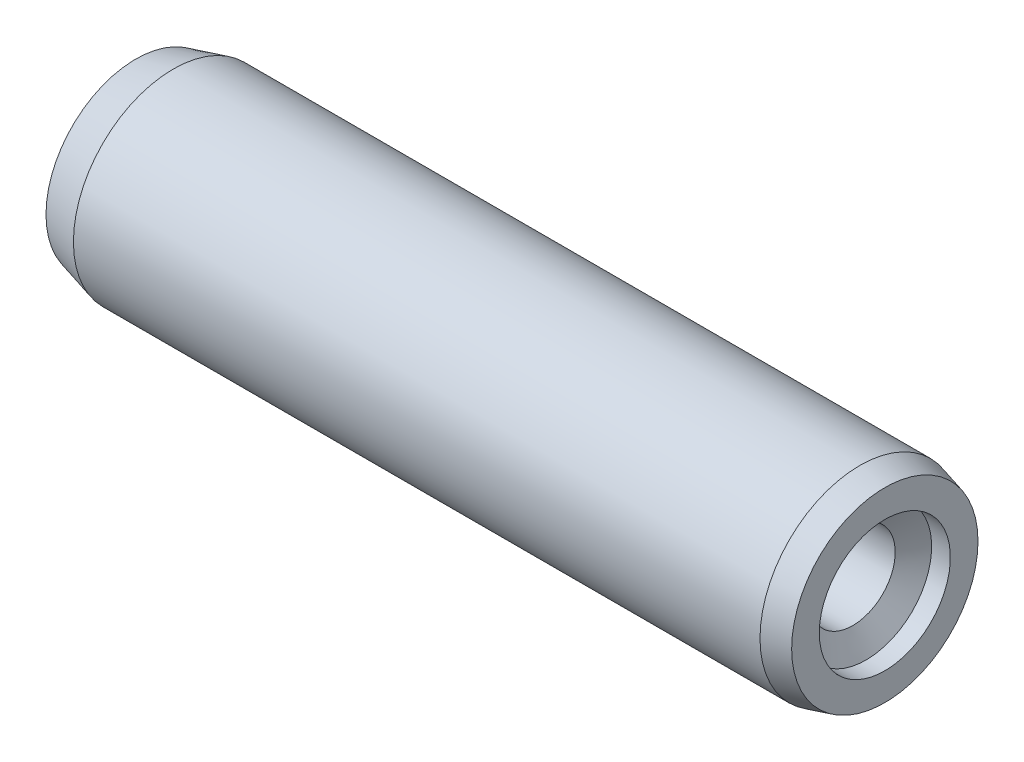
ISO-10303-21;
HEADER;
FILE_DESCRIPTION(('STEP AP214'),'2;1');
FILE_NAME('part.step','',(''),(''),'','','');
FILE_SCHEMA(('AUTOMOTIVE_DESIGN { 1 0 10303 214 1 1 1 1 }'));
ENDSEC;
DATA;
#1=APPLICATION_CONTEXT('core data for automotive mechanical design processes');
#2=APPLICATION_PROTOCOL_DEFINITION('international standard','automotive_design',2000,#1);
#3=PRODUCT_CONTEXT('',#1,'mechanical');
#4=PRODUCT('Part','Part','',(#3));
#5=PRODUCT_RELATED_PRODUCT_CATEGORY('part','',(#4));
#6=PRODUCT_DEFINITION_FORMATION('','',#4);
#7=PRODUCT_DEFINITION_CONTEXT('part definition',#1,'design');
#8=PRODUCT_DEFINITION('design','',#6,#7);
#9=PRODUCT_DEFINITION_SHAPE('','',#8);
#10=(LENGTH_UNIT() NAMED_UNIT(*) SI_UNIT(.MILLI.,.METRE.));
#11=(NAMED_UNIT(*) PLANE_ANGLE_UNIT() SI_UNIT($,.RADIAN.));
#12=(NAMED_UNIT(*) SI_UNIT($,.STERADIAN.) SOLID_ANGLE_UNIT());
#13=UNCERTAINTY_MEASURE_WITH_UNIT(LENGTH_MEASURE(1.E-05),#10,'distance_accuracy_value','');
#14=(GEOMETRIC_REPRESENTATION_CONTEXT(3) GLOBAL_UNCERTAINTY_ASSIGNED_CONTEXT((#13)) GLOBAL_UNIT_ASSIGNED_CONTEXT((#10,
#11,#12)) REPRESENTATION_CONTEXT('',''));
#15=CARTESIAN_POINT('',(0.,0.,0.));
#16=DIRECTION('',(0.,0.,1.));
#17=DIRECTION('',(1.,0.,0.));
#18=AXIS2_PLACEMENT_3D('',#15,#16,#17);
#19=CARTESIAN_POINT('',(60.,7.46410161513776,0.));
#20=DIRECTION('',(-1.,0.,0.));
#21=DIRECTION('',(0.,0.,1.));
#22=AXIS2_PLACEMENT_3D('',#19,#20,#21);
#23=PLANE('',#22);
#24=CARTESIAN_POINT('',(60.,0.,0.));
#25=DIRECTION('',(-1.,0.,0.));
#26=DIRECTION('',(0.,0.,1.));
#27=AXIS2_PLACEMENT_3D('',#24,#25,#26);
#28=CIRCLE('',#27,7.46410161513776);
#29=CARTESIAN_POINT('',(60.,0.,7.46410161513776));
#30=VERTEX_POINT('',#29);
#31=EDGE_CURVE('E71',#30,#30,#28,.T.);
#32=ORIENTED_EDGE('',*,*,#31,.F.);
#33=EDGE_LOOP('',(#32));
#34=FACE_BOUND('',#33,.T.);
#35=CARTESIAN_POINT('',(60.,0.,0.));
#36=DIRECTION('',(-1.,0.,0.));
#37=DIRECTION('',(0.,0.,1.));
#38=AXIS2_PLACEMENT_3D('',#35,#36,#37);
#39=CIRCLE('',#38,5.25);
#40=CARTESIAN_POINT('',(60.,0.,5.25));
#41=VERTEX_POINT('',#40);
#42=EDGE_CURVE('E11',#41,#41,#39,.T.);
#43=ORIENTED_EDGE('',*,*,#42,.T.);
#44=EDGE_LOOP('',(#43));
#45=FACE_BOUND('',#44,.T.);
#46=ADVANCED_FACE('F35',(#34,#45),#23,.F.);
#47=CARTESIAN_POINT('',(0.,0.,0.));
#48=DIRECTION('',(-1.,0.,0.));
#49=DIRECTION('',(0.,0.,1.));
#50=AXIS2_PLACEMENT_3D('',#47,#48,#49);
#51=CYLINDRICAL_SURFACE('',#50,5.25);
#52=ORIENTED_EDGE('',*,*,#42,.F.);
#53=EDGE_LOOP('',(#52));
#54=FACE_BOUND('',#53,.T.);
#55=CARTESIAN_POINT('',(58.5,0.,0.));
#56=DIRECTION('',(-1.,0.,0.));
#57=DIRECTION('',(0.,0.,1.));
#58=AXIS2_PLACEMENT_3D('',#55,#56,#57);
#59=CIRCLE('',#58,5.25);
#60=CARTESIAN_POINT('',(58.5,0.,5.25));
#61=VERTEX_POINT('',#60);
#62=EDGE_CURVE('E41',#61,#61,#59,.T.);
#63=ORIENTED_EDGE('',*,*,#62,.T.);
#64=EDGE_LOOP('',(#63));
#65=FACE_BOUND('',#64,.T.);
#66=ADVANCED_FACE('F62',(#54,#65),#51,.F.);
#67=CARTESIAN_POINT('',(57.4319020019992,0.,0.));
#68=DIRECTION('',(1.,0.,0.));
#69=DIRECTION('',(0.,0.,-1.));
#70=AXIS2_PLACEMENT_3D('',#67,#68,#69);
#71=CONICAL_SURFACE('',#70,3.4,1.0471975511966);
#72=ORIENTED_EDGE('',*,*,#62,.F.);
#73=EDGE_LOOP('',(#72));
#74=FACE_BOUND('',#73,.T.);
#75=CARTESIAN_POINT('',(57.4319020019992,0.,0.));
#76=DIRECTION('',(-1.,0.,0.));
#77=DIRECTION('',(0.,0.,1.));
#78=AXIS2_PLACEMENT_3D('',#75,#76,#77);
#79=CIRCLE('',#78,3.4);
#80=CARTESIAN_POINT('',(57.4319020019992,0.,3.4));
#81=VERTEX_POINT('',#80);
#82=EDGE_CURVE('E77',#81,#81,#79,.T.);
#83=ORIENTED_EDGE('',*,*,#82,.T.);
#84=EDGE_LOOP('',(#83));
#85=FACE_BOUND('',#84,.T.);
#86=ADVANCED_FACE('F57',(#74,#85),#71,.F.);
#87=CARTESIAN_POINT('',(0.,0.,0.));
#88=DIRECTION('',(-1.,0.,0.));
#89=DIRECTION('',(0.,0.,1.));
#90=AXIS2_PLACEMENT_3D('',#87,#88,#89);
#91=CYLINDRICAL_SURFACE('',#90,3.4);
#92=ORIENTED_EDGE('',*,*,#82,.F.);
#93=EDGE_LOOP('',(#92));
#94=FACE_BOUND('',#93,.T.);
#95=CARTESIAN_POINT('',(35.,0.,0.));
#96=DIRECTION('',(-1.,0.,0.));
#97=DIRECTION('',(0.,0.,1.));
#98=AXIS2_PLACEMENT_3D('',#95,#96,#97);
#99=CIRCLE('',#98,3.4);
#100=CARTESIAN_POINT('',(35.,0.,3.4));
#101=VERTEX_POINT('',#100);
#102=EDGE_CURVE('E79',#101,#101,#99,.T.);
#103=ORIENTED_EDGE('',*,*,#102,.T.);
#104=EDGE_LOOP('',(#103));
#105=FACE_BOUND('',#104,.T.);
#106=ADVANCED_FACE('F47',(#94,#105),#91,.F.);
#107=CARTESIAN_POINT('',(33.5916738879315,0.,0.));
#108=DIRECTION('',(1.,0.,0.));
#109=DIRECTION('',(0.,0.,-1.));
#110=AXIS2_PLACEMENT_3D('',#107,#108,#109);
#111=CONICAL_SURFACE('',#110,0.,1.17809724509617);
#112=ORIENTED_EDGE('',*,*,#102,.F.);
#113=EDGE_LOOP('',(#112));
#114=FACE_BOUND('',#113,.T.);
#115=CARTESIAN_POINT('',(33.5916738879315,0.,0.));
#116=VERTEX_POINT('',#115);
#117=VERTEX_LOOP('',#116);
#118=FACE_BOUND('',#117,.T.);
#119=ADVANCED_FACE('F44',(#114,#118),#111,.F.);
#120=CARTESIAN_POINT('',(0.,0.,0.));
#121=DIRECTION('',(1.,0.,0.));
#122=DIRECTION('',(0.,0.,-1.));
#123=AXIS2_PLACEMENT_3D('',#120,#121,#122);
#124=PLANE('',#123);
#125=CARTESIAN_POINT('',(0.,0.,0.));
#126=DIRECTION('',(-1.,0.,0.));
#127=DIRECTION('',(0.,0.,1.));
#128=AXIS2_PLACEMENT_3D('',#125,#126,#127);
#129=CIRCLE('',#128,7.19615242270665);
#130=CARTESIAN_POINT('',(0.,0.,7.19615242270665));
#131=VERTEX_POINT('',#130);
#132=EDGE_CURVE('E84',#131,#131,#129,.T.);
#133=ORIENTED_EDGE('',*,*,#132,.T.);
#134=EDGE_LOOP('',(#133));
#135=FACE_BOUND('',#134,.T.);
#136=ADVANCED_FACE('F46',(#135),#124,.F.);
#137=CARTESIAN_POINT('',(3.,0.,0.));
#138=DIRECTION('',(1.,0.,0.));
#139=DIRECTION('',(0.,0.,-1.));
#140=AXIS2_PLACEMENT_3D('',#137,#138,#139);
#141=CONICAL_SURFACE('',#140,8.,0.261799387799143);
#142=ORIENTED_EDGE('',*,*,#132,.F.);
#143=EDGE_LOOP('',(#142));
#144=FACE_BOUND('',#143,.T.);
#145=CARTESIAN_POINT('',(3.,0.,0.));
#146=DIRECTION('',(-1.,0.,0.));
#147=DIRECTION('',(0.,0.,1.));
#148=AXIS2_PLACEMENT_3D('',#145,#146,#147);
#149=CIRCLE('',#148,8.);
#150=CARTESIAN_POINT('',(3.,0.,8.));
#151=VERTEX_POINT('',#150);
#152=EDGE_CURVE('E87',#151,#151,#149,.T.);
#153=ORIENTED_EDGE('',*,*,#152,.T.);
#154=EDGE_LOOP('',(#153));
#155=FACE_BOUND('',#154,.T.);
#156=ADVANCED_FACE('F54',(#144,#155),#141,.T.);
#157=CARTESIAN_POINT('',(0.,0.,0.));
#158=DIRECTION('',(-1.,0.,0.));
#159=DIRECTION('',(0.,0.,1.));
#160=AXIS2_PLACEMENT_3D('',#157,#158,#159);
#161=CYLINDRICAL_SURFACE('',#160,8.);
#162=ORIENTED_EDGE('',*,*,#152,.F.);
#163=EDGE_LOOP('',(#162));
#164=FACE_BOUND('',#163,.T.);
#165=CARTESIAN_POINT('',(58.,0.,0.));
#166=DIRECTION('',(-1.,0.,0.));
#167=DIRECTION('',(0.,0.,1.));
#168=AXIS2_PLACEMENT_3D('',#165,#166,#167);
#169=CIRCLE('',#168,8.);
#170=CARTESIAN_POINT('',(58.,0.,8.));
#171=VERTEX_POINT('',#170);
#172=EDGE_CURVE('E90',#171,#171,#169,.T.);
#173=ORIENTED_EDGE('',*,*,#172,.T.);
#174=EDGE_LOOP('',(#173));
#175=FACE_BOUND('',#174,.T.);
#176=ADVANCED_FACE('F96',(#164,#175),#161,.T.);
#177=CARTESIAN_POINT('',(60.,0.,0.));
#178=DIRECTION('',(-1.,0.,0.));
#179=DIRECTION('',(0.,0.,1.));
#180=AXIS2_PLACEMENT_3D('',#177,#178,#179);
#181=CONICAL_SURFACE('',#180,7.46410161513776,0.261799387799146);
#182=ORIENTED_EDGE('',*,*,#172,.F.);
#183=EDGE_LOOP('',(#182));
#184=FACE_BOUND('',#183,.T.);
#185=ORIENTED_EDGE('',*,*,#31,.T.);
#186=EDGE_LOOP('',(#185));
#187=FACE_BOUND('',#186,.T.);
#188=ADVANCED_FACE('F94',(#184,#187),#181,.T.);
#189=CLOSED_SHELL('',(#46,#66,#86,#106,#119,#136,#156,#176,#188));
#190=MANIFOLD_SOLID_BREP('B2',#189);
#191=ADVANCED_BREP_SHAPE_REPRESENTATION('',(#18,#190),#14);
#192=SHAPE_DEFINITION_REPRESENTATION(#9,#191);
ENDSEC;
END-ISO-10303-21;
